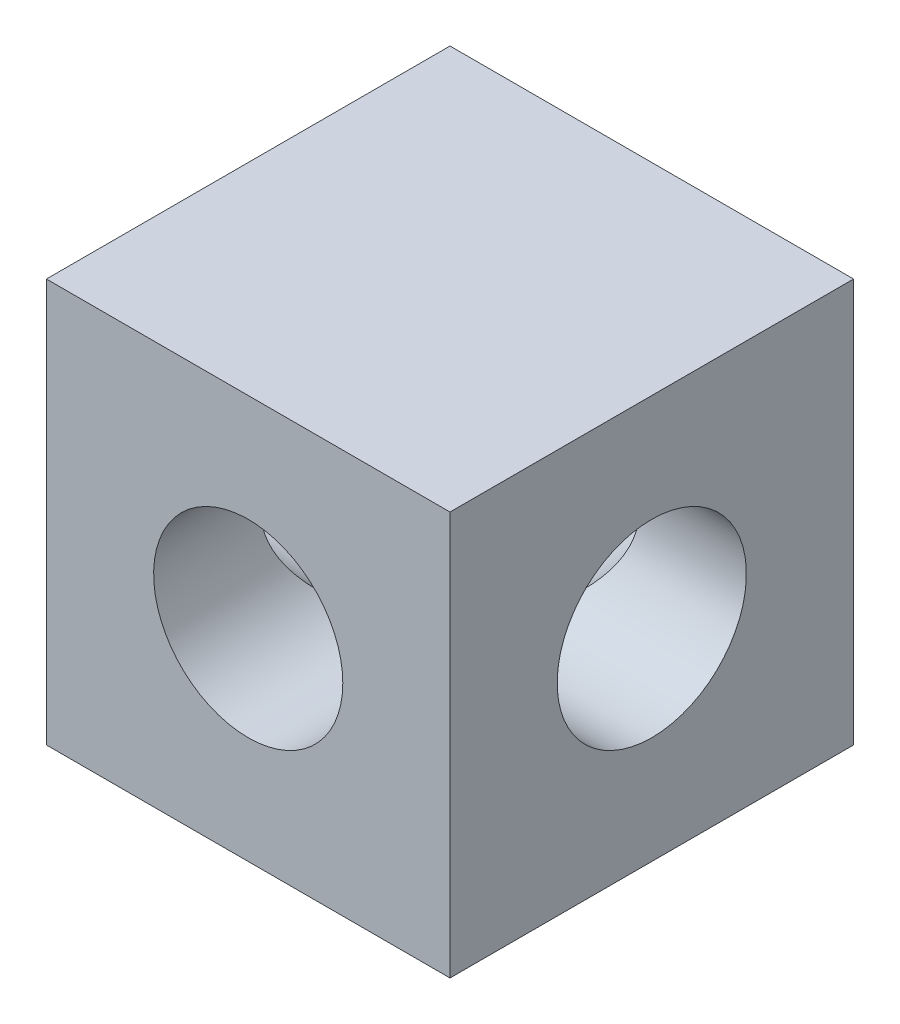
from build123d import *

# Parameters (mm, degrees)
SKETCH1_W          = 20.32
SKETCH1_H          = 20.32
SKETCH1_R          = 4.7625
BASE_EXTRUDE_DEPTH = 20.32
SKETCH3_R          = 4.7625
CUT_EXTRUDE1_DEPTH = 35.282899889


with BuildPart() as part:
    # Sketch1 → Base-Extrude (new body)
    with BuildSketch(Plane.XY):
        with Locations((-16.978268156, 8.535251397)):
            Rectangle(SKETCH1_W, SKETCH1_H)
        with Locations((-16.978268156, 8.535251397)):
            Circle(SKETCH1_R, mode=Mode.SUBTRACT)
    extrude(amount=BASE_EXTRUDE_DEPTH)

    # Sketch3 → Cut-Extrude1 (cut, through all)
    with BuildSketch(Plane(origin=(-6.818268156, 0, 0), x_dir=(0, 0, -1), z_dir=(1, 0, 0))):
        with Locations(Location((-10.16, 8.535251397, 0), (0, 0, 90))):
            Circle(SKETCH3_R)
    extrude(amount=-CUT_EXTRUDE1_DEPTH, mode=Mode.SUBTRACT)


solid = part.part
